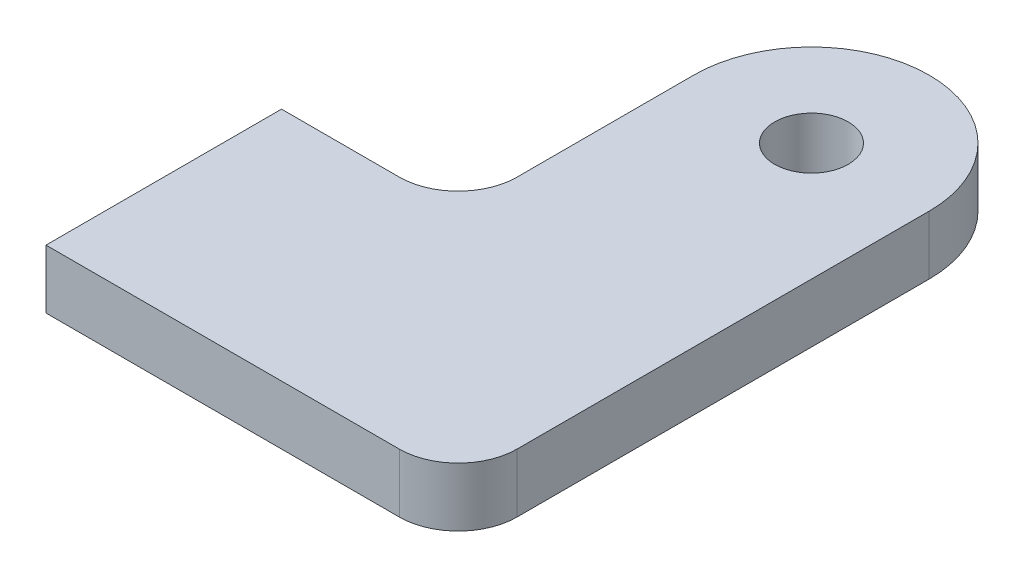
ISO-10303-21;
HEADER;
FILE_DESCRIPTION(('STEP AP214'),'2;1');
FILE_NAME('part.step','',(''),(''),'','','');
FILE_SCHEMA(('AUTOMOTIVE_DESIGN { 1 0 10303 214 1 1 1 1 }'));
ENDSEC;
DATA;
#1=APPLICATION_CONTEXT('core data for automotive mechanical design processes');
#2=APPLICATION_PROTOCOL_DEFINITION('international standard','automotive_design',2000,#1);
#3=PRODUCT_CONTEXT('',#1,'mechanical');
#4=PRODUCT('Part','Part','',(#3));
#5=PRODUCT_RELATED_PRODUCT_CATEGORY('part','',(#4));
#6=PRODUCT_DEFINITION_FORMATION('','',#4);
#7=PRODUCT_DEFINITION_CONTEXT('part definition',#1,'design');
#8=PRODUCT_DEFINITION('design','',#6,#7);
#9=PRODUCT_DEFINITION_SHAPE('','',#8);
#10=(LENGTH_UNIT() NAMED_UNIT(*) SI_UNIT(.MILLI.,.METRE.));
#11=(NAMED_UNIT(*) PLANE_ANGLE_UNIT() SI_UNIT($,.RADIAN.));
#12=(NAMED_UNIT(*) SI_UNIT($,.STERADIAN.) SOLID_ANGLE_UNIT());
#13=UNCERTAINTY_MEASURE_WITH_UNIT(LENGTH_MEASURE(1.E-05),#10,'distance_accuracy_value','');
#14=(GEOMETRIC_REPRESENTATION_CONTEXT(3) GLOBAL_UNCERTAINTY_ASSIGNED_CONTEXT((#13)) GLOBAL_UNIT_ASSIGNED_CONTEXT((#10,
#11,#12)) REPRESENTATION_CONTEXT('',''));
#15=CARTESIAN_POINT('',(0.,0.,0.));
#16=DIRECTION('',(0.,0.,1.));
#17=DIRECTION('',(1.,0.,0.));
#18=AXIS2_PLACEMENT_3D('',#15,#16,#17);
#19=CARTESIAN_POINT('',(38.1,6.35,-6.35));
#20=DIRECTION('',(0.,1.,0.));
#21=DIRECTION('',(0.,0.,1.));
#22=AXIS2_PLACEMENT_3D('',#19,#20,#21);
#23=PLANE('',#22);
#24=DIRECTION('',(0.,0.,1.));
#25=VECTOR('',#24,1.);
#26=CARTESIAN_POINT('',(0.,6.35,-25.4));
#27=LINE('',#26,#25);
#28=CARTESIAN_POINT('',(0.,6.35,-25.4));
#29=VERTEX_POINT('',#28);
#30=CARTESIAN_POINT('',(0.,6.35,0.));
#31=VERTEX_POINT('',#30);
#32=EDGE_CURVE('E148',#29,#31,#27,.T.);
#33=ORIENTED_EDGE('',*,*,#32,.T.);
#34=DIRECTION('',(1.,0.,0.));
#35=VECTOR('',#34,1.);
#36=CARTESIAN_POINT('',(38.1,6.35,0.));
#37=LINE('',#36,#35);
#38=CARTESIAN_POINT('',(38.1,6.35,0.));
#39=VERTEX_POINT('',#38);
#40=EDGE_CURVE('E96',#31,#39,#37,.T.);
#41=ORIENTED_EDGE('',*,*,#40,.T.);
#42=CARTESIAN_POINT('',(38.1,6.35,-6.35));
#43=DIRECTION('',(0.,1.,0.));
#44=DIRECTION('',(0.,0.,1.));
#45=AXIS2_PLACEMENT_3D('',#42,#43,#44);
#46=CIRCLE('',#45,6.35);
#47=CARTESIAN_POINT('',(44.45,6.35,-6.35000000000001));
#48=VERTEX_POINT('',#47);
#49=EDGE_CURVE('E163',#39,#48,#46,.T.);
#50=ORIENTED_EDGE('',*,*,#49,.T.);
#51=DIRECTION('',(0.,0.,-1.));
#52=VECTOR('',#51,1.);
#53=CARTESIAN_POINT('',(44.45,6.35,-50.8));
#54=LINE('',#53,#52);
#55=CARTESIAN_POINT('',(44.45,6.35,-50.8));
#56=VERTEX_POINT('',#55);
#57=EDGE_CURVE('E176',#48,#56,#54,.T.);
#58=ORIENTED_EDGE('',*,*,#57,.T.);
#59=CARTESIAN_POINT('',(31.75,6.35,-50.8));
#60=DIRECTION('',(0.,1.,0.));
#61=DIRECTION('',(0.,0.,-1.));
#62=AXIS2_PLACEMENT_3D('',#59,#60,#61);
#63=CIRCLE('',#62,12.7);
#64=CARTESIAN_POINT('',(19.05,6.35,-50.8));
#65=VERTEX_POINT('',#64);
#66=EDGE_CURVE('E115',#56,#65,#63,.T.);
#67=ORIENTED_EDGE('',*,*,#66,.T.);
#68=DIRECTION('',(0.,0.,1.));
#69=VECTOR('',#68,1.);
#70=CARTESIAN_POINT('',(19.05,6.35,-31.75));
#71=LINE('',#70,#69);
#72=CARTESIAN_POINT('',(19.05,6.35,-31.75));
#73=VERTEX_POINT('',#72);
#74=EDGE_CURVE('E109',#65,#73,#71,.T.);
#75=ORIENTED_EDGE('',*,*,#74,.T.);
#76=CARTESIAN_POINT('',(12.7,6.35,-31.75));
#77=DIRECTION('',(0.,-1.,0.));
#78=DIRECTION('',(0.,0.,1.));
#79=AXIS2_PLACEMENT_3D('',#76,#77,#78);
#80=CIRCLE('',#79,6.35);
#81=CARTESIAN_POINT('',(12.7,6.35,-25.4));
#82=VERTEX_POINT('',#81);
#83=EDGE_CURVE('E113',#73,#82,#80,.T.);
#84=ORIENTED_EDGE('',*,*,#83,.T.);
#85=DIRECTION('',(-1.,0.,0.));
#86=VECTOR('',#85,1.);
#87=CARTESIAN_POINT('',(0.,6.35,-25.4));
#88=LINE('',#87,#86);
#89=EDGE_CURVE('E53',#82,#29,#88,.T.);
#90=ORIENTED_EDGE('',*,*,#89,.T.);
#91=EDGE_LOOP('',(#33,#41,#50,#58,#67,#75,#84,#90));
#92=FACE_BOUND('',#91,.T.);
#93=CARTESIAN_POINT('',(31.75,6.35,-50.8));
#94=DIRECTION('',(0.,1.,0.));
#95=DIRECTION('',(0.,0.,1.));
#96=AXIS2_PLACEMENT_3D('',#93,#94,#95);
#97=CIRCLE('',#96,3.96875);
#98=CARTESIAN_POINT('',(31.75,6.35,-46.83125));
#99=VERTEX_POINT('',#98);
#100=EDGE_CURVE('E137',#99,#99,#97,.T.);
#101=ORIENTED_EDGE('',*,*,#100,.F.);
#102=EDGE_LOOP('',(#101));
#103=FACE_BOUND('',#102,.T.);
#104=ADVANCED_FACE('F36',(#92,#103),#23,.T.);
#105=CARTESIAN_POINT('',(38.1,0.,-6.35));
#106=DIRECTION('',(0.,1.,0.));
#107=DIRECTION('',(0.,0.,1.));
#108=AXIS2_PLACEMENT_3D('',#105,#106,#107);
#109=PLANE('',#108);
#110=DIRECTION('',(0.,0.,1.));
#111=VECTOR('',#110,1.);
#112=CARTESIAN_POINT('',(0.,0.,-25.4));
#113=LINE('',#112,#111);
#114=CARTESIAN_POINT('',(0.,0.,-25.4));
#115=VERTEX_POINT('',#114);
#116=CARTESIAN_POINT('',(0.,0.,0.));
#117=VERTEX_POINT('',#116);
#118=EDGE_CURVE('E133',#115,#117,#113,.T.);
#119=ORIENTED_EDGE('',*,*,#118,.F.);
#120=DIRECTION('',(-1.,0.,0.));
#121=VECTOR('',#120,1.);
#122=CARTESIAN_POINT('',(0.,0.,-25.4));
#123=LINE('',#122,#121);
#124=CARTESIAN_POINT('',(12.7,0.,-25.4));
#125=VERTEX_POINT('',#124);
#126=EDGE_CURVE('E88',#125,#115,#123,.T.);
#127=ORIENTED_EDGE('',*,*,#126,.F.);
#128=CARTESIAN_POINT('',(12.7,0.,-31.75));
#129=DIRECTION('',(0.,-1.,0.));
#130=DIRECTION('',(0.,0.,1.));
#131=AXIS2_PLACEMENT_3D('',#128,#129,#130);
#132=CIRCLE('',#131,6.35);
#133=CARTESIAN_POINT('',(19.05,0.,-31.75));
#134=VERTEX_POINT('',#133);
#135=EDGE_CURVE('E82',#134,#125,#132,.T.);
#136=ORIENTED_EDGE('',*,*,#135,.F.);
#137=DIRECTION('',(0.,0.,1.));
#138=VECTOR('',#137,1.);
#139=CARTESIAN_POINT('',(19.05,0.,-31.75));
#140=LINE('',#139,#138);
#141=CARTESIAN_POINT('',(19.05,0.,-50.8));
#142=VERTEX_POINT('',#141);
#143=EDGE_CURVE('E123',#142,#134,#140,.T.);
#144=ORIENTED_EDGE('',*,*,#143,.F.);
#145=CARTESIAN_POINT('',(31.75,0.,-50.8));
#146=DIRECTION('',(0.,1.,0.));
#147=DIRECTION('',(0.,0.,-1.));
#148=AXIS2_PLACEMENT_3D('',#145,#146,#147);
#149=CIRCLE('',#148,12.7);
#150=CARTESIAN_POINT('',(44.45,0.,-50.8));
#151=VERTEX_POINT('',#150);
#152=EDGE_CURVE('E143',#151,#142,#149,.T.);
#153=ORIENTED_EDGE('',*,*,#152,.F.);
#154=DIRECTION('',(0.,0.,-1.));
#155=VECTOR('',#154,1.);
#156=CARTESIAN_POINT('',(44.45,0.,-50.8));
#157=LINE('',#156,#155);
#158=CARTESIAN_POINT('',(44.45,0.,-6.35000000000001));
#159=VERTEX_POINT('',#158);
#160=EDGE_CURVE('E141',#159,#151,#157,.T.);
#161=ORIENTED_EDGE('',*,*,#160,.F.);
#162=CARTESIAN_POINT('',(38.1,0.,-6.35));
#163=DIRECTION('',(0.,1.,0.));
#164=DIRECTION('',(0.,0.,1.));
#165=AXIS2_PLACEMENT_3D('',#162,#163,#164);
#166=CIRCLE('',#165,6.35);
#167=CARTESIAN_POINT('',(38.1,0.,0.));
#168=VERTEX_POINT('',#167);
#169=EDGE_CURVE('E139',#168,#159,#166,.T.);
#170=ORIENTED_EDGE('',*,*,#169,.F.);
#171=DIRECTION('',(1.,0.,0.));
#172=VECTOR('',#171,1.);
#173=CARTESIAN_POINT('',(38.1,0.,0.));
#174=LINE('',#173,#172);
#175=EDGE_CURVE('E136',#117,#168,#174,.T.);
#176=ORIENTED_EDGE('',*,*,#175,.F.);
#177=EDGE_LOOP('',(#119,#127,#136,#144,#153,#161,#170,#176));
#178=FACE_BOUND('',#177,.T.);
#179=CARTESIAN_POINT('',(31.75,0.,-50.8));
#180=DIRECTION('',(0.,1.,0.));
#181=DIRECTION('',(0.,0.,1.));
#182=AXIS2_PLACEMENT_3D('',#179,#180,#181);
#183=CIRCLE('',#182,3.96875);
#184=CARTESIAN_POINT('',(31.75,0.,-46.83125));
#185=VERTEX_POINT('',#184);
#186=EDGE_CURVE('E182',#185,#185,#183,.T.);
#187=ORIENTED_EDGE('',*,*,#186,.T.);
#188=EDGE_LOOP('',(#187));
#189=FACE_BOUND('',#188,.T.);
#190=ADVANCED_FACE('F167',(#178,#189),#109,.F.);
#191=CARTESIAN_POINT('',(0.,6.35,-25.4));
#192=DIRECTION('',(1.,0.,0.));
#193=DIRECTION('',(0.,0.,-1.));
#194=AXIS2_PLACEMENT_3D('',#191,#192,#193);
#195=PLANE('',#194);
#196=ORIENTED_EDGE('',*,*,#118,.T.);
#197=DIRECTION('',(0.,-1.,0.));
#198=VECTOR('',#197,1.);
#199=CARTESIAN_POINT('',(0.,6.35,0.));
#200=LINE('',#199,#198);
#201=EDGE_CURVE('E11',#31,#117,#200,.T.);
#202=ORIENTED_EDGE('',*,*,#201,.F.);
#203=ORIENTED_EDGE('',*,*,#32,.F.);
#204=DIRECTION('',(0.,-1.,0.));
#205=VECTOR('',#204,1.);
#206=CARTESIAN_POINT('',(0.,6.35,-25.4));
#207=LINE('',#206,#205);
#208=EDGE_CURVE('E129',#29,#115,#207,.T.);
#209=ORIENTED_EDGE('',*,*,#208,.T.);
#210=EDGE_LOOP('',(#196,#202,#203,#209));
#211=FACE_BOUND('',#210,.T.);
#212=ADVANCED_FACE('F38',(#211),#195,.F.);
#213=CARTESIAN_POINT('',(38.1,6.35,0.));
#214=DIRECTION('',(0.,0.,-1.));
#215=DIRECTION('',(-1.,0.,0.));
#216=AXIS2_PLACEMENT_3D('',#213,#214,#215);
#217=PLANE('',#216);
#218=ORIENTED_EDGE('',*,*,#175,.T.);
#219=DIRECTION('',(0.,-1.,0.));
#220=VECTOR('',#219,1.);
#221=CARTESIAN_POINT('',(38.1,6.35,0.));
#222=LINE('',#221,#220);
#223=EDGE_CURVE('E45',#39,#168,#222,.T.);
#224=ORIENTED_EDGE('',*,*,#223,.F.);
#225=ORIENTED_EDGE('',*,*,#40,.F.);
#226=ORIENTED_EDGE('',*,*,#201,.T.);
#227=EDGE_LOOP('',(#218,#224,#225,#226));
#228=FACE_BOUND('',#227,.T.);
#229=ADVANCED_FACE('F210',(#228),#217,.F.);
#230=CARTESIAN_POINT('',(38.1,6.35,-6.35));
#231=DIRECTION('',(0.,-1.,0.));
#232=DIRECTION('',(0.,0.,-1.));
#233=AXIS2_PLACEMENT_3D('',#230,#231,#232);
#234=CYLINDRICAL_SURFACE('',#233,6.35);
#235=ORIENTED_EDGE('',*,*,#169,.T.);
#236=DIRECTION('',(0.,-1.,0.));
#237=VECTOR('',#236,1.);
#238=CARTESIAN_POINT('',(44.45,6.35,-6.35000000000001));
#239=LINE('',#238,#237);
#240=EDGE_CURVE('E155',#48,#159,#239,.T.);
#241=ORIENTED_EDGE('',*,*,#240,.F.);
#242=ORIENTED_EDGE('',*,*,#49,.F.);
#243=ORIENTED_EDGE('',*,*,#223,.T.);
#244=EDGE_LOOP('',(#235,#241,#242,#243));
#245=FACE_BOUND('',#244,.T.);
#246=ADVANCED_FACE('F161',(#245),#234,.T.);
#247=CARTESIAN_POINT('',(44.45,6.35,-50.8));
#248=DIRECTION('',(-1.,0.,0.));
#249=DIRECTION('',(0.,0.,1.));
#250=AXIS2_PLACEMENT_3D('',#247,#248,#249);
#251=PLANE('',#250);
#252=ORIENTED_EDGE('',*,*,#160,.T.);
#253=DIRECTION('',(0.,-1.,0.));
#254=VECTOR('',#253,1.);
#255=CARTESIAN_POINT('',(44.45,6.35,-50.8));
#256=LINE('',#255,#254);
#257=EDGE_CURVE('E152',#56,#151,#256,.T.);
#258=ORIENTED_EDGE('',*,*,#257,.F.);
#259=ORIENTED_EDGE('',*,*,#57,.F.);
#260=ORIENTED_EDGE('',*,*,#240,.T.);
#261=EDGE_LOOP('',(#252,#258,#259,#260));
#262=FACE_BOUND('',#261,.T.);
#263=ADVANCED_FACE('F172',(#262),#251,.F.);
#264=CARTESIAN_POINT('',(31.75,6.35,-50.8));
#265=DIRECTION('',(0.,-1.,0.));
#266=DIRECTION('',(0.,0.,-1.));
#267=AXIS2_PLACEMENT_3D('',#264,#265,#266);
#268=CYLINDRICAL_SURFACE('',#267,12.7);
#269=ORIENTED_EDGE('',*,*,#152,.T.);
#270=DIRECTION('',(0.,-1.,0.));
#271=VECTOR('',#270,1.);
#272=CARTESIAN_POINT('',(19.05,6.35,-50.8));
#273=LINE('',#272,#271);
#274=EDGE_CURVE('E124',#65,#142,#273,.T.);
#275=ORIENTED_EDGE('',*,*,#274,.F.);
#276=ORIENTED_EDGE('',*,*,#66,.F.);
#277=ORIENTED_EDGE('',*,*,#257,.T.);
#278=EDGE_LOOP('',(#269,#275,#276,#277));
#279=FACE_BOUND('',#278,.T.);
#280=ADVANCED_FACE('F175',(#279),#268,.T.);
#281=CARTESIAN_POINT('',(19.05,6.35,-31.75));
#282=DIRECTION('',(1.,0.,0.));
#283=DIRECTION('',(0.,0.,-1.));
#284=AXIS2_PLACEMENT_3D('',#281,#282,#283);
#285=PLANE('',#284);
#286=ORIENTED_EDGE('',*,*,#143,.T.);
#287=DIRECTION('',(0.,-1.,0.));
#288=VECTOR('',#287,1.);
#289=CARTESIAN_POINT('',(19.05,6.35,-31.75));
#290=LINE('',#289,#288);
#291=EDGE_CURVE('E120',#73,#134,#290,.T.);
#292=ORIENTED_EDGE('',*,*,#291,.F.);
#293=ORIENTED_EDGE('',*,*,#74,.F.);
#294=ORIENTED_EDGE('',*,*,#274,.T.);
#295=EDGE_LOOP('',(#286,#292,#293,#294));
#296=FACE_BOUND('',#295,.T.);
#297=ADVANCED_FACE('F121',(#296),#285,.F.);
#298=CARTESIAN_POINT('',(12.7,6.35,-31.75));
#299=DIRECTION('',(0.,-1.,0.));
#300=DIRECTION('',(0.,0.,-1.));
#301=AXIS2_PLACEMENT_3D('',#298,#299,#300);
#302=CYLINDRICAL_SURFACE('',#301,6.35);
#303=ORIENTED_EDGE('',*,*,#135,.T.);
#304=DIRECTION('',(0.,-1.,0.));
#305=VECTOR('',#304,1.);
#306=CARTESIAN_POINT('',(12.7,6.35,-25.4));
#307=LINE('',#306,#305);
#308=EDGE_CURVE('E125',#82,#125,#307,.T.);
#309=ORIENTED_EDGE('',*,*,#308,.F.);
#310=ORIENTED_EDGE('',*,*,#83,.F.);
#311=ORIENTED_EDGE('',*,*,#291,.T.);
#312=EDGE_LOOP('',(#303,#309,#310,#311));
#313=FACE_BOUND('',#312,.T.);
#314=ADVANCED_FACE('F127',(#313),#302,.F.);
#315=CARTESIAN_POINT('',(0.,6.35,-25.4));
#316=DIRECTION('',(0.,0.,1.));
#317=DIRECTION('',(1.,0.,0.));
#318=AXIS2_PLACEMENT_3D('',#315,#316,#317);
#319=PLANE('',#318);
#320=ORIENTED_EDGE('',*,*,#126,.T.);
#321=ORIENTED_EDGE('',*,*,#208,.F.);
#322=ORIENTED_EDGE('',*,*,#89,.F.);
#323=ORIENTED_EDGE('',*,*,#308,.T.);
#324=EDGE_LOOP('',(#320,#321,#322,#323));
#325=FACE_BOUND('',#324,.T.);
#326=ADVANCED_FACE('F198',(#325),#319,.F.);
#327=CARTESIAN_POINT('',(31.75,6.35,-50.8));
#328=DIRECTION('',(0.,-1.,0.));
#329=DIRECTION('',(0.,0.,-1.));
#330=AXIS2_PLACEMENT_3D('',#327,#328,#329);
#331=CYLINDRICAL_SURFACE('',#330,3.96875);
#332=ORIENTED_EDGE('',*,*,#100,.T.);
#333=EDGE_LOOP('',(#332));
#334=FACE_BOUND('',#333,.T.);
#335=ORIENTED_EDGE('',*,*,#186,.F.);
#336=EDGE_LOOP('',(#335));
#337=FACE_BOUND('',#336,.T.);
#338=ADVANCED_FACE('F188',(#334,#337),#331,.F.);
#339=CLOSED_SHELL('',(#104,#190,#212,#229,#246,#263,#280,#297,#314,#326,#338));
#340=MANIFOLD_SOLID_BREP('B2',#339);
#341=ADVANCED_BREP_SHAPE_REPRESENTATION('',(#18,#340),#14);
#342=SHAPE_DEFINITION_REPRESENTATION(#9,#341);
ENDSEC;
END-ISO-10303-21;
